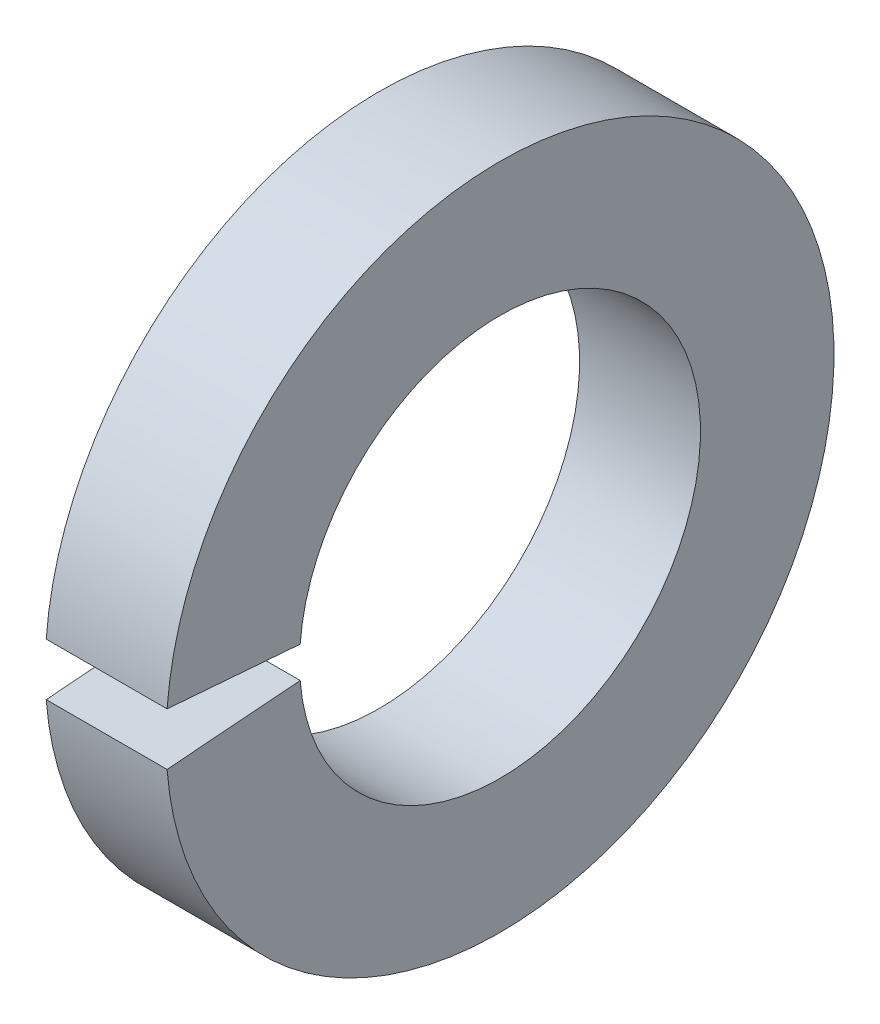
from build123d import *

# Parameters (mm, degrees)
SKETCH1_W = 7.7724
SKETCH1_H = 8.5852
GAP_DEPTH = 32.349985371


with BuildPart() as part:
    # Sketch1 → Base-Revolve (revolve)
    with BuildSketch(Plane.XY, mode=Mode.PRIVATE) as base_revolve_sk:
        with Locations((-3.8862, 17.1831)):
            Rectangle(SKETCH1_W, SKETCH1_H)
    revolve(base_revolve_sk.sketch.rotate(Axis((-34.925, 0, 0), (1, 0, 0)), 90), axis=Axis((-34.925, 0, 0), (1, 0, 0)))

    # Sketch2 → Gap (cut, through all)
    with BuildSketch(Plane(origin=(0, 0, 0), x_dir=(0, -1, 0), z_dir=(-1, 0, 0))):
        with BuildLine():
            Line((0, 0), (1.718663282, 21.837687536))
            ThreePointArc((1.718663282, 21.837687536), (0, 21.905214), (-1.718663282, 21.837687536))
            Line((-1.718663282, 21.837687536), (0, 0))
        make_face()
    extrude(amount=GAP_DEPTH, mode=Mode.SUBTRACT)


solid = part.part
